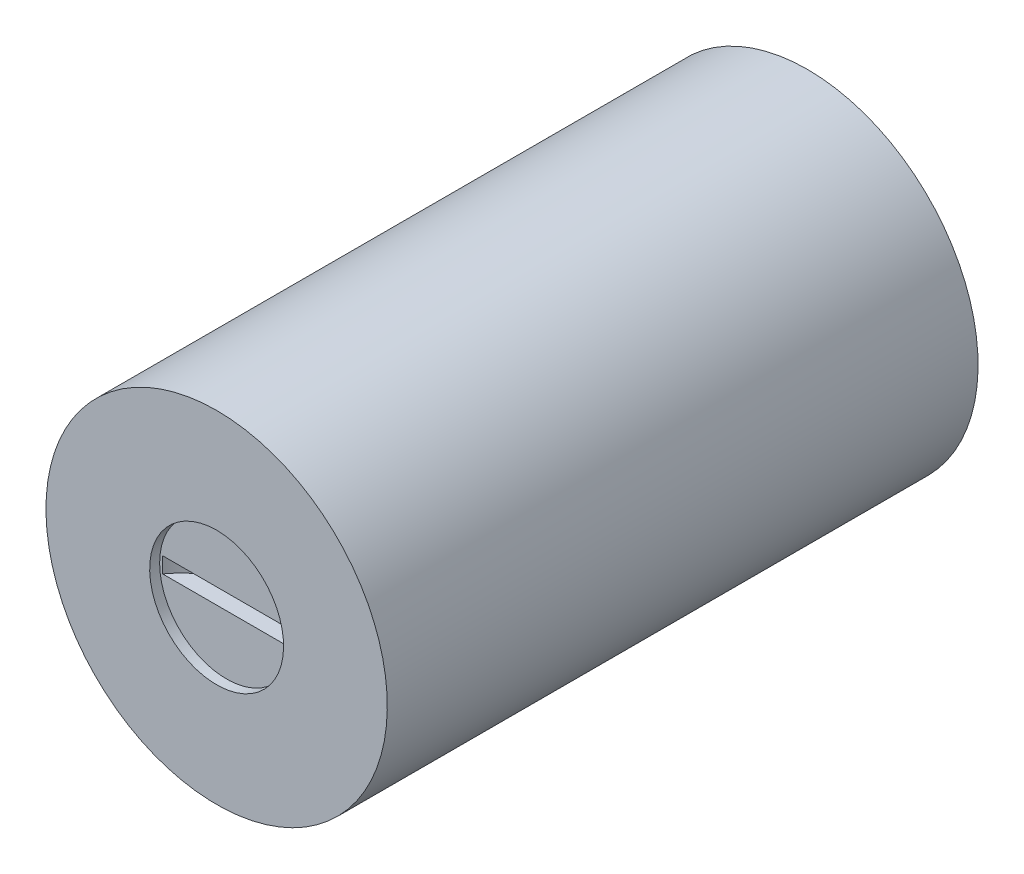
ISO-10303-21;
HEADER;
FILE_DESCRIPTION(('STEP AP214'),'2;1');
FILE_NAME('part.step','',(''),(''),'','','');
FILE_SCHEMA(('AUTOMOTIVE_DESIGN { 1 0 10303 214 1 1 1 1 }'));
ENDSEC;
DATA;
#1=APPLICATION_CONTEXT('core data for automotive mechanical design processes');
#2=APPLICATION_PROTOCOL_DEFINITION('international standard','automotive_design',2000,#1);
#3=PRODUCT_CONTEXT('',#1,'mechanical');
#4=PRODUCT('Part','Part','',(#3));
#5=PRODUCT_RELATED_PRODUCT_CATEGORY('part','',(#4));
#6=PRODUCT_DEFINITION_FORMATION('','',#4);
#7=PRODUCT_DEFINITION_CONTEXT('part definition',#1,'design');
#8=PRODUCT_DEFINITION('design','',#6,#7);
#9=PRODUCT_DEFINITION_SHAPE('','',#8);
#10=(LENGTH_UNIT() NAMED_UNIT(*) SI_UNIT(.MILLI.,.METRE.));
#11=(NAMED_UNIT(*) PLANE_ANGLE_UNIT() SI_UNIT($,.RADIAN.));
#12=(NAMED_UNIT(*) SI_UNIT($,.STERADIAN.) SOLID_ANGLE_UNIT());
#13=UNCERTAINTY_MEASURE_WITH_UNIT(LENGTH_MEASURE(1.E-05),#10,'distance_accuracy_value','');
#14=(GEOMETRIC_REPRESENTATION_CONTEXT(3) GLOBAL_UNCERTAINTY_ASSIGNED_CONTEXT((#13)) GLOBAL_UNIT_ASSIGNED_CONTEXT((#10,
#11,#12)) REPRESENTATION_CONTEXT('',''));
#15=CARTESIAN_POINT('',(0.,0.,0.));
#16=DIRECTION('',(0.,0.,1.));
#17=DIRECTION('',(1.,0.,0.));
#18=AXIS2_PLACEMENT_3D('',#15,#16,#17);
#19=CARTESIAN_POINT('',(35.,0.,67.));
#20=DIRECTION('',(0.,0.,1.));
#21=DIRECTION('',(0.,1.,0.));
#22=AXIS2_PLACEMENT_3D('',#19,#20,#21);
#23=CYLINDRICAL_SURFACE('',#22,5.1);
#24=CARTESIAN_POINT('',(35.,0.,67.));
#25=DIRECTION('',(0.,0.,1.));
#26=DIRECTION('',(0.,1.,0.));
#27=AXIS2_PLACEMENT_3D('',#24,#25,#26);
#28=CIRCLE('',#27,5.1);
#29=CARTESIAN_POINT('',(35.,5.1,67.));
#30=VERTEX_POINT('',#29);
#31=EDGE_CURVE('E59',#30,#30,#28,.T.);
#32=ORIENTED_EDGE('',*,*,#31,.T.);
#33=EDGE_LOOP('',(#32));
#34=FACE_BOUND('',#33,.T.);
#35=CARTESIAN_POINT('',(35.,0.,66.2418584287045));
#36=DIRECTION('',(0.,0.,-1.));
#37=DIRECTION('',(-1.,0.,0.));
#38=AXIS2_PLACEMENT_3D('',#35,#36,#37);
#39=CIRCLE('',#38,5.1);
#40=CARTESIAN_POINT('',(29.9,0.,66.2418584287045));
#41=VERTEX_POINT('',#40);
#42=EDGE_CURVE('E9',#41,#41,#39,.T.);
#43=ORIENTED_EDGE('',*,*,#42,.T.);
#44=EDGE_LOOP('',(#43));
#45=FACE_BOUND('',#44,.T.);
#46=ADVANCED_FACE('F14',(#34,#45),#23,.F.);
#47=CARTESIAN_POINT('',(35.,0.,13.4924429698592));
#48=DIRECTION('',(0.,0.,1.));
#49=DIRECTION('',(0.,1.,0.));
#50=AXIS2_PLACEMENT_3D('',#47,#48,#49);
#51=CYLINDRICAL_SURFACE('',#50,13.);
#52=CARTESIAN_POINT('',(35.,0.,67.));
#53=DIRECTION('',(0.,0.,1.));
#54=DIRECTION('',(0.,1.,0.));
#55=AXIS2_PLACEMENT_3D('',#52,#53,#54);
#56=CIRCLE('',#55,13.);
#57=CARTESIAN_POINT('',(35.,13.,67.));
#58=VERTEX_POINT('',#57);
#59=EDGE_CURVE('E61',#58,#58,#56,.T.);
#60=ORIENTED_EDGE('',*,*,#59,.F.);
#61=EDGE_LOOP('',(#60));
#62=FACE_BOUND('',#61,.T.);
#63=CARTESIAN_POINT('',(35.,0.,22.));
#64=DIRECTION('',(0.,0.,-1.));
#65=DIRECTION('',(-1.,0.,0.));
#66=AXIS2_PLACEMENT_3D('',#63,#64,#65);
#67=CIRCLE('',#66,13.);
#68=CARTESIAN_POINT('',(22.,0.,22.));
#69=VERTEX_POINT('',#68);
#70=EDGE_CURVE('E62',#69,#69,#67,.T.);
#71=ORIENTED_EDGE('',*,*,#70,.F.);
#72=EDGE_LOOP('',(#71));
#73=FACE_BOUND('',#72,.T.);
#74=ADVANCED_FACE('F16',(#62,#73),#51,.T.);
#75=CARTESIAN_POINT('',(22.,0.,67.));
#76=DIRECTION('',(0.,0.,-1.));
#77=DIRECTION('',(0.,-1.,0.));
#78=AXIS2_PLACEMENT_3D('',#75,#76,#77);
#79=PLANE('',#78);
#80=ORIENTED_EDGE('',*,*,#31,.F.);
#81=EDGE_LOOP('',(#80));
#82=FACE_BOUND('',#81,.T.);
#83=ORIENTED_EDGE('',*,*,#59,.T.);
#84=EDGE_LOOP('',(#83));
#85=FACE_BOUND('',#84,.T.);
#86=ADVANCED_FACE('F74',(#82,#85),#79,.F.);
#87=CARTESIAN_POINT('',(35.,0.,66.2418584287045));
#88=DIRECTION('',(0.,0.,-1.));
#89=DIRECTION('',(1.,0.,0.));
#90=AXIS2_PLACEMENT_3D('',#87,#88,#89);
#91=PLANE('',#90);
#92=DIRECTION('',(-1.,0.,0.));
#93=VECTOR('',#92,1.);
#94=CARTESIAN_POINT('',(39.8733971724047,0.6,66.2418584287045));
#95=LINE('',#94,#93);
#96=CARTESIAN_POINT('',(39.8733971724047,0.6,66.2418584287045));
#97=VERTEX_POINT('',#96);
#98=CARTESIAN_POINT('',(30.1266028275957,0.6,66.2418584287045));
#99=VERTEX_POINT('',#98);
#100=EDGE_CURVE('E46',#97,#99,#95,.T.);
#101=ORIENTED_EDGE('',*,*,#100,.F.);
#102=DIRECTION('',(0.,-1.,0.));
#103=VECTOR('',#102,1.);
#104=CARTESIAN_POINT('',(39.8733971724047,1.2,66.2418584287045));
#105=LINE('',#104,#103);
#106=CARTESIAN_POINT('',(39.8733971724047,-0.6,66.2418584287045));
#107=VERTEX_POINT('',#106);
#108=EDGE_CURVE('E22',#97,#107,#105,.T.);
#109=ORIENTED_EDGE('',*,*,#108,.T.);
#110=DIRECTION('',(1.,0.,0.));
#111=VECTOR('',#110,1.);
#112=CARTESIAN_POINT('',(30.1266028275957,-0.6,66.2418584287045));
#113=LINE('',#112,#111);
#114=CARTESIAN_POINT('',(30.1266028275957,-0.6,66.2418584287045));
#115=VERTEX_POINT('',#114);
#116=EDGE_CURVE('E45',#115,#107,#113,.T.);
#117=ORIENTED_EDGE('',*,*,#116,.F.);
#118=DIRECTION('',(0.,-1.,0.));
#119=VECTOR('',#118,1.);
#120=CARTESIAN_POINT('',(30.1266028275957,1.2,66.2418584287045));
#121=LINE('',#120,#119);
#122=EDGE_CURVE('E48',#115,#99,#121,.F.);
#123=ORIENTED_EDGE('',*,*,#122,.T.);
#124=EDGE_LOOP('',(#101,#109,#117,#123));
#125=FACE_BOUND('',#124,.T.);
#126=ORIENTED_EDGE('',*,*,#42,.F.);
#127=EDGE_LOOP('',(#126));
#128=FACE_BOUND('',#127,.T.);
#129=ADVANCED_FACE('F53',(#125,#128),#91,.F.);
#130=CARTESIAN_POINT('',(35.,1.2,69.7418584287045));
#131=DIRECTION('',(0.,-1.,0.));
#132=DIRECTION('',(-1.,0.,0.));
#133=AXIS2_PLACEMENT_3D('',#130,#131,#132);
#134=CYLINDRICAL_SURFACE('',#133,6.);
#135=ORIENTED_EDGE('',*,*,#108,.F.);
#136=CARTESIAN_POINT('',(35.,0.6,69.7418584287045));
#137=DIRECTION('',(0.,-1.,0.));
#138=DIRECTION('',(0.,0.,1.));
#139=AXIS2_PLACEMENT_3D('',#136,#137,#138);
#140=CIRCLE('',#139,6.);
#141=EDGE_CURVE('E28',#99,#97,#140,.T.);
#142=ORIENTED_EDGE('',*,*,#141,.F.);
#143=ORIENTED_EDGE('',*,*,#122,.F.);
#144=CARTESIAN_POINT('',(35.,-0.6,69.7418584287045));
#145=DIRECTION('',(0.,1.,0.));
#146=DIRECTION('',(0.,0.,-1.));
#147=AXIS2_PLACEMENT_3D('',#144,#145,#146);
#148=CIRCLE('',#147,6.);
#149=EDGE_CURVE('E42',#107,#115,#148,.T.);
#150=ORIENTED_EDGE('',*,*,#149,.F.);
#151=EDGE_LOOP('',(#135,#142,#143,#150));
#152=FACE_BOUND('',#151,.T.);
#153=ADVANCED_FACE('F49',(#152),#134,.F.);
#154=CARTESIAN_POINT('',(35.,-0.6,69.7418584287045));
#155=DIRECTION('',(0.,1.,0.));
#156=DIRECTION('',(0.,0.,-1.));
#157=AXIS2_PLACEMENT_3D('',#154,#155,#156);
#158=PLANE('',#157);
#159=ORIENTED_EDGE('',*,*,#149,.T.);
#160=ORIENTED_EDGE('',*,*,#116,.T.);
#161=EDGE_LOOP('',(#159,#160));
#162=FACE_BOUND('',#161,.T.);
#163=ADVANCED_FACE('F43',(#162),#158,.T.);
#164=CARTESIAN_POINT('',(35.,0.6,69.7418584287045));
#165=DIRECTION('',(0.,-1.,0.));
#166=DIRECTION('',(0.,0.,1.));
#167=AXIS2_PLACEMENT_3D('',#164,#165,#166);
#168=PLANE('',#167);
#169=ORIENTED_EDGE('',*,*,#141,.T.);
#170=ORIENTED_EDGE('',*,*,#100,.T.);
#171=EDGE_LOOP('',(#169,#170));
#172=FACE_BOUND('',#171,.T.);
#173=ADVANCED_FACE('F91',(#172),#168,.T.);
#174=CARTESIAN_POINT('',(25.5,0.,22.));
#175=DIRECTION('',(0.,0.,1.));
#176=DIRECTION('',(0.,1.,0.));
#177=AXIS2_PLACEMENT_3D('',#174,#175,#176);
#178=PLANE('',#177);
#179=ORIENTED_EDGE('',*,*,#70,.T.);
#180=EDGE_LOOP('',(#179));
#181=FACE_BOUND('',#180,.T.);
#182=ADVANCED_FACE('F71',(#181),#178,.F.);
#183=CLOSED_SHELL('',(#46,#74,#86,#129,#153,#163,#173,#182));
#184=MANIFOLD_SOLID_BREP('B1',#183);
#185=ADVANCED_BREP_SHAPE_REPRESENTATION('',(#18,#184),#14);
#186=SHAPE_DEFINITION_REPRESENTATION(#9,#185);
ENDSEC;
END-ISO-10303-21;
